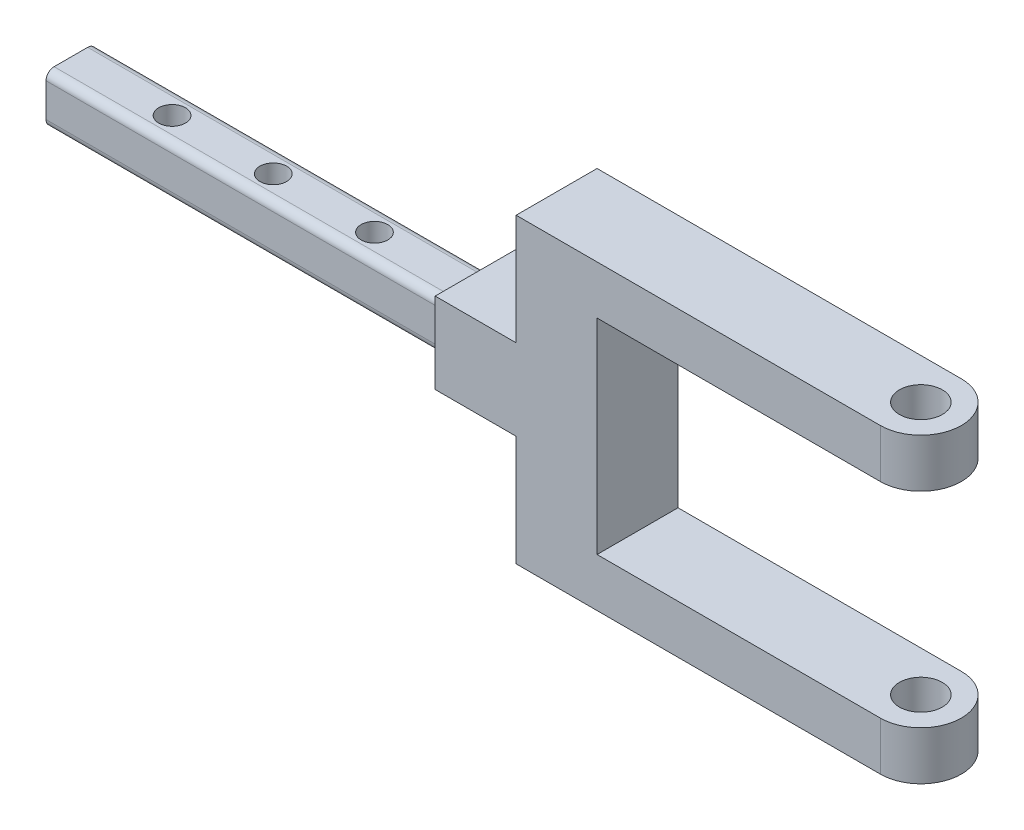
from build123d import *

# Parameters (mm, degrees)
EXTRUDE_1_DEPTH     = 10
SKETCH_2_W          = 10
SKETCH_2_H          = 10
SKETCH_2_W_2        = 6.15
SKETCH_2_H_2        = 6.15
EXTRUDE_2_DEPTH     = 10
EXTRUDE_START       = 10
SKETCH_2_3_W        = 6.15
SKETCH_2_3_H        = 6.15
EXTRUDE_3_DEPTH     = 50
CUT_EXTRUDE_1_DEPTH = 80.945543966
SKETCH_4_R          = 1.65
CUT_EXTRUDE_2_DEPTH = 74.972803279
FILLET_1_R          = 1


with BuildPart() as part:
    # Sketch 1 → Extrude 1 (new body)
    with BuildSketch(Plane.XY):
        Polygon((0, 12.65), (0, -12.65), (40, -12.65), (40, -18.65), (-10, -18.65), (-10, 18.65), (40, 18.65), (40, 12.65), align=None)
    extrude(amount=EXTRUDE_1_DEPTH)

    # Sketch 2 → Extrude 2 (add)
    # profile 1 of 2: a face of its own
    with BuildSketch(Plane.ZY.offset(10)):
        with Locations((5, 0)):
            Rectangle(SKETCH_2_W, SKETCH_2_H)
        with Locations((5, 0)):
            Rectangle(SKETCH_2_W_2, SKETCH_2_H_2, mode=Mode.SUBTRACT)
    # profile 2 of 2: a face of its own
    with BuildSketch(Plane.ZY.offset(10)):
        with Locations((5, 0)):
            Rectangle(SKETCH_2_W_2, SKETCH_2_H_2)
    extrude(amount=EXTRUDE_2_DEPTH)

    # Sketch 2_3 → Extrude 3 (add)
    with BuildSketch(Plane.ZY.offset(10).offset(EXTRUDE_START)):
        with Locations((5, 0)):
            Rectangle(SKETCH_2_3_W, SKETCH_2_3_H)
    extrude(amount=EXTRUDE_3_DEPTH)

    # Sketch 3 → Cut-Extrude 1 (cut, through all)
    with BuildSketch(Plane(origin=(0, 18.65, 0), x_dir=(1, 0, 0), z_dir=(0, 1, 0))):
        with BuildLine():
            ThreePointArc((32.35, -5), (35, -7.65), (37.65, -5))
            Line((37.65, -5), (32.35, -5))
        make_face()
        with BuildLine():
            Line((32.35, -5), (37.65, -5))
            ThreePointArc((37.65, -5), (35, -2.35), (32.35, -5))
        make_face()
        with BuildLine():
            ThreePointArc((32.35, -5), (35, -7.65), (37.65, -5))
            Line((37.65, -5), (32.35, -5))
        make_face()
        with BuildLine():
            Line((32.35, -5), (37.65, -5))
            ThreePointArc((37.65, -5), (35, -2.35), (32.35, -5))
        make_face()
        with BuildLine():
            ThreePointArc((35, 0), (38.535533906, -1.464466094), (40, -5))
            Line((40, -5), (40, 0))
            Line((40, 0), (35, 0))
        make_face()
        with BuildLine():
            Line((40, -10), (40, -5))
            ThreePointArc((40, -5), (38.535533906, -8.535533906), (35, -10))
            Line((35, -10), (40, -10))
        make_face()
    extrude(amount=-CUT_EXTRUDE_1_DEPTH, mode=Mode.SUBTRACT)

    # Sketch 4 → Cut-Extrude 2 (cut, through all)
    with BuildSketch(Plane(origin=(0, 3.075, 0), x_dir=(1, 0, 0), z_dir=(0, 1, 0))):
        with Locations(Location((-45, -5, 0), (0, 0, 180))):
            Circle(SKETCH_4_R)
        with Locations(Location((-57.5, -5, 0), (0, 0, 180))):
            Circle(SKETCH_4_R)
        with Locations(Location((-32.5, -5, 0), (0, 0, 180))):
            Circle(SKETCH_4_R)
    extrude(amount=-CUT_EXTRUDE_2_DEPTH, mode=Mode.SUBTRACT)

    # Fillet 1
    fillet_1_edges = [part.edges().sort_by_distance(p)[0] for p in [
        (-45, -3.075, 1.925),
        (-45, -3.075, 8.075),
        (-45, 3.075, 8.075),
        (-45, 3.075, 1.925),
    ]]
    fillet(fillet_1_edges, radius=FILLET_1_R)


solid = part.part
